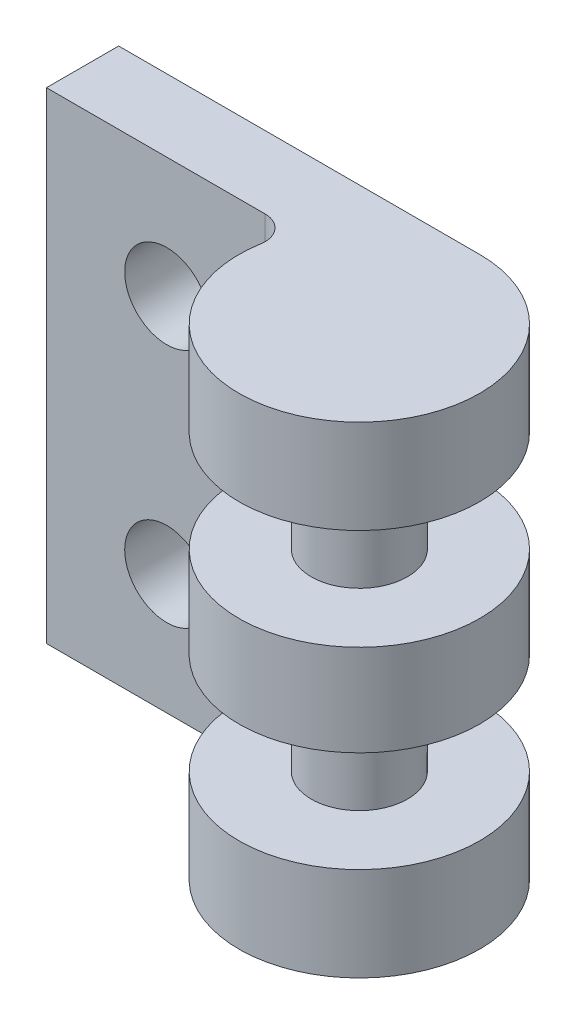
ISO-10303-21;
HEADER;
FILE_DESCRIPTION(('STEP AP214'),'2;1');
FILE_NAME('part.step','',(''),(''),'','','');
FILE_SCHEMA(('AUTOMOTIVE_DESIGN { 1 0 10303 214 1 1 1 1 }'));
ENDSEC;
DATA;
#1=APPLICATION_CONTEXT('core data for automotive mechanical design processes');
#2=APPLICATION_PROTOCOL_DEFINITION('international standard','automotive_design',2000,#1);
#3=PRODUCT_CONTEXT('',#1,'mechanical');
#4=PRODUCT('Part','Part','',(#3));
#5=PRODUCT_RELATED_PRODUCT_CATEGORY('part','',(#4));
#6=PRODUCT_DEFINITION_FORMATION('','',#4);
#7=PRODUCT_DEFINITION_CONTEXT('part definition',#1,'design');
#8=PRODUCT_DEFINITION('design','',#6,#7);
#9=PRODUCT_DEFINITION_SHAPE('','',#8);
#10=(LENGTH_UNIT() NAMED_UNIT(*) SI_UNIT(.MILLI.,.METRE.));
#11=(NAMED_UNIT(*) PLANE_ANGLE_UNIT() SI_UNIT($,.RADIAN.));
#12=(NAMED_UNIT(*) SI_UNIT($,.STERADIAN.) SOLID_ANGLE_UNIT());
#13=UNCERTAINTY_MEASURE_WITH_UNIT(LENGTH_MEASURE(1.E-05),#10,'distance_accuracy_value','');
#14=(GEOMETRIC_REPRESENTATION_CONTEXT(3) GLOBAL_UNCERTAINTY_ASSIGNED_CONTEXT((#13)) GLOBAL_UNIT_ASSIGNED_CONTEXT((#10,
#11,#12)) REPRESENTATION_CONTEXT('',''));
#15=CARTESIAN_POINT('',(0.,0.,0.));
#16=DIRECTION('',(0.,0.,1.));
#17=DIRECTION('',(1.,0.,0.));
#18=AXIS2_PLACEMENT_3D('',#15,#16,#17);
#19=CARTESIAN_POINT('',(10.,10.,5.));
#20=DIRECTION('',(0.,-1.,0.));
#21=DIRECTION('',(0.,0.,-1.));
#22=AXIS2_PLACEMENT_3D('',#19,#20,#21);
#23=CYLINDRICAL_SURFACE('',#22,5.);
#24=CARTESIAN_POINT('',(10.,10.,5.));
#25=DIRECTION('',(0.,1.,0.));
#26=DIRECTION('',(0.,0.,1.));
#27=AXIS2_PLACEMENT_3D('',#24,#25,#26);
#28=CIRCLE('',#27,5.);
#29=CARTESIAN_POINT('',(5.06993351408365,10.,4.16666666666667));
#30=VERTEX_POINT('',#29);
#31=CARTESIAN_POINT('',(10.,10.,0.));
#32=VERTEX_POINT('',#31);
#33=EDGE_CURVE('E206',#30,#32,#28,.T.);
#34=ORIENTED_EDGE('',*,*,#33,.F.);
#35=DIRECTION('',(0.,-1.,0.));
#36=VECTOR('',#35,1.);
#37=CARTESIAN_POINT('',(5.06993351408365,10.,4.16666666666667));
#38=LINE('',#37,#36);
#39=CARTESIAN_POINT('',(5.06993351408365,6.1,4.16666666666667));
#40=VERTEX_POINT('',#39);
#41=EDGE_CURVE('E289',#30,#40,#38,.T.);
#42=ORIENTED_EDGE('',*,*,#41,.T.);
#43=CARTESIAN_POINT('',(10.,6.1,5.));
#44=DIRECTION('',(0.,1.,0.));
#45=DIRECTION('',(0.,0.,1.));
#46=AXIS2_PLACEMENT_3D('',#43,#44,#45);
#47=CIRCLE('',#46,5.);
#48=CARTESIAN_POINT('',(10.,6.1,0.));
#49=VERTEX_POINT('',#48);
#50=EDGE_CURVE('E252',#40,#49,#47,.T.);
#51=ORIENTED_EDGE('',*,*,#50,.T.);
#52=DIRECTION('',(0.,-1.,0.));
#53=VECTOR('',#52,1.);
#54=CARTESIAN_POINT('',(10.,10.,0.));
#55=LINE('',#54,#53);
#56=EDGE_CURVE('E210',#32,#49,#55,.T.);
#57=ORIENTED_EDGE('',*,*,#56,.F.);
#58=EDGE_LOOP('',(#34,#42,#51,#57));
#59=FACE_BOUND('',#58,.T.);
#60=ADVANCED_FACE('F37',(#59),#23,.T.);
#61=CARTESIAN_POINT('',(10.,-6.1,5.));
#62=DIRECTION('',(0.,-1.,0.));
#63=DIRECTION('',(0.,0.,-1.));
#64=AXIS2_PLACEMENT_3D('',#61,#62,#63);
#65=CIRCLE('',#64,5.);
#66=CARTESIAN_POINT('',(10.,-6.1,0.));
#67=VERTEX_POINT('',#66);
#68=CARTESIAN_POINT('',(5.06993351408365,-6.1,4.16666666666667));
#69=VERTEX_POINT('',#68);
#70=EDGE_CURVE('E163',#67,#69,#65,.T.);
#71=ORIENTED_EDGE('',*,*,#70,.T.);
#72=DIRECTION('',(0.,-1.,0.));
#73=VECTOR('',#72,1.);
#74=CARTESIAN_POINT('',(5.06993351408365,10.,4.16666666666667));
#75=LINE('',#74,#73);
#76=CARTESIAN_POINT('',(5.06993351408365,-10.,4.16666666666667));
#77=VERTEX_POINT('',#76);
#78=EDGE_CURVE('E277',#69,#77,#75,.T.);
#79=ORIENTED_EDGE('',*,*,#78,.T.);
#80=CARTESIAN_POINT('',(10.,-10.,5.));
#81=DIRECTION('',(0.,1.,0.));
#82=DIRECTION('',(0.,0.,1.));
#83=AXIS2_PLACEMENT_3D('',#80,#81,#82);
#84=CIRCLE('',#83,5.);
#85=CARTESIAN_POINT('',(10.,-10.,0.));
#86=VERTEX_POINT('',#85);
#87=EDGE_CURVE('E205',#77,#86,#84,.T.);
#88=ORIENTED_EDGE('',*,*,#87,.T.);
#89=EDGE_CURVE('E208',#67,#86,#55,.T.);
#90=ORIENTED_EDGE('',*,*,#89,.F.);
#91=EDGE_LOOP('',(#71,#79,#88,#90));
#92=FACE_BOUND('',#91,.T.);
#93=ADVANCED_FACE('F328',(#92),#23,.T.);
#94=CARTESIAN_POINT('',(0.,0.,3.));
#95=DIRECTION('',(0.,0.,-1.));
#96=DIRECTION('',(-1.,0.,0.));
#97=AXIS2_PLACEMENT_3D('',#94,#95,#96);
#98=PLANE('',#97);
#99=DIRECTION('',(1.,0.,0.));
#100=VECTOR('',#99,1.);
#101=CARTESIAN_POINT('',(-5.,-10.,3.));
#102=LINE('',#101,#100);
#103=CARTESIAN_POINT('',(-5.,-10.,3.));
#104=VERTEX_POINT('',#103);
#105=CARTESIAN_POINT('',(4.08392021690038,-10.,3.));
#106=VERTEX_POINT('',#105);
#107=EDGE_CURVE('E232',#104,#106,#102,.T.);
#108=ORIENTED_EDGE('',*,*,#107,.T.);
#109=DIRECTION('',(0.,1.,0.));
#110=VECTOR('',#109,1.);
#111=CARTESIAN_POINT('',(4.08392021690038,-6.1,3.));
#112=LINE('',#111,#110);
#113=CARTESIAN_POINT('',(4.08392021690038,-6.1,3.));
#114=VERTEX_POINT('',#113);
#115=EDGE_CURVE('E284',#106,#114,#112,.T.);
#116=ORIENTED_EDGE('',*,*,#115,.T.);
#117=DIRECTION('',(-1.,0.,0.));
#118=VECTOR('',#117,1.);
#119=CARTESIAN_POINT('',(0.,-6.1,3.));
#120=LINE('',#119,#118);
#121=CARTESIAN_POINT('',(4.,-6.1,3.));
#122=VERTEX_POINT('',#121);
#123=EDGE_CURVE('E168',#114,#122,#120,.T.);
#124=ORIENTED_EDGE('',*,*,#123,.T.);
#125=DIRECTION('',(0.,1.,0.));
#126=VECTOR('',#125,1.);
#127=CARTESIAN_POINT('',(4.,0.,3.));
#128=LINE('',#127,#126);
#129=CARTESIAN_POINT('',(4.,-1.9,3.));
#130=VERTEX_POINT('',#129);
#131=EDGE_CURVE('E261',#122,#130,#128,.T.);
#132=ORIENTED_EDGE('',*,*,#131,.T.);
#133=DIRECTION('',(1.,0.,0.));
#134=VECTOR('',#133,1.);
#135=CARTESIAN_POINT('',(0.,-1.9,3.));
#136=LINE('',#135,#134);
#137=CARTESIAN_POINT('',(4.08392021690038,-1.9,3.));
#138=VERTEX_POINT('',#137);
#139=EDGE_CURVE('E192',#130,#138,#136,.T.);
#140=ORIENTED_EDGE('',*,*,#139,.T.);
#141=DIRECTION('',(0.,1.,0.));
#142=VECTOR('',#141,1.);
#143=CARTESIAN_POINT('',(4.08392021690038,1.9,3.));
#144=LINE('',#143,#142);
#145=CARTESIAN_POINT('',(4.08392021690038,1.9,3.));
#146=VERTEX_POINT('',#145);
#147=EDGE_CURVE('E282',#138,#146,#144,.T.);
#148=ORIENTED_EDGE('',*,*,#147,.T.);
#149=DIRECTION('',(-1.,0.,0.));
#150=VECTOR('',#149,1.);
#151=CARTESIAN_POINT('',(0.,1.9,3.));
#152=LINE('',#151,#150);
#153=CARTESIAN_POINT('',(4.,1.9,3.));
#154=VERTEX_POINT('',#153);
#155=EDGE_CURVE('E190',#146,#154,#152,.T.);
#156=ORIENTED_EDGE('',*,*,#155,.T.);
#157=DIRECTION('',(0.,1.,0.));
#158=VECTOR('',#157,1.);
#159=CARTESIAN_POINT('',(4.,0.,3.));
#160=LINE('',#159,#158);
#161=CARTESIAN_POINT('',(4.,6.1,3.));
#162=VERTEX_POINT('',#161);
#163=EDGE_CURVE('E258',#154,#162,#160,.T.);
#164=ORIENTED_EDGE('',*,*,#163,.T.);
#165=DIRECTION('',(1.,0.,0.));
#166=VECTOR('',#165,1.);
#167=CARTESIAN_POINT('',(0.,6.1,3.));
#168=LINE('',#167,#166);
#169=CARTESIAN_POINT('',(4.08392021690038,6.1,3.));
#170=VERTEX_POINT('',#169);
#171=EDGE_CURVE('E200',#162,#170,#168,.T.);
#172=ORIENTED_EDGE('',*,*,#171,.T.);
#173=DIRECTION('',(0.,1.,0.));
#174=VECTOR('',#173,1.);
#175=CARTESIAN_POINT('',(4.08392021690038,10.,3.));
#176=LINE('',#175,#174);
#177=CARTESIAN_POINT('',(4.08392021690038,10.,3.));
#178=VERTEX_POINT('',#177);
#179=EDGE_CURVE('E280',#170,#178,#176,.T.);
#180=ORIENTED_EDGE('',*,*,#179,.T.);
#181=DIRECTION('',(-1.,0.,0.));
#182=VECTOR('',#181,1.);
#183=CARTESIAN_POINT('',(-5.,10.,3.));
#184=LINE('',#183,#182);
#185=CARTESIAN_POINT('',(-5.,10.,3.));
#186=VERTEX_POINT('',#185);
#187=EDGE_CURVE('E227',#178,#186,#184,.T.);
#188=ORIENTED_EDGE('',*,*,#187,.T.);
#189=DIRECTION('',(0.,-1.,0.));
#190=VECTOR('',#189,1.);
#191=CARTESIAN_POINT('',(-5.,-10.,3.));
#192=LINE('',#191,#190);
#193=EDGE_CURVE('E229',#186,#104,#192,.T.);
#194=ORIENTED_EDGE('',*,*,#193,.T.);
#195=EDGE_LOOP('',(#108,#116,#124,#132,#140,#148,#156,#164,#172,#180,#188,#194));
#196=FACE_BOUND('',#195,.T.);
#197=CARTESIAN_POINT('',(0.,5.,3.));
#198=DIRECTION('',(0.,0.,1.));
#199=DIRECTION('',(1.,0.,0.));
#200=AXIS2_PLACEMENT_3D('',#197,#198,#199);
#201=CIRCLE('',#200,1.75);
#202=CARTESIAN_POINT('',(1.75,5.,3.));
#203=VERTEX_POINT('',#202);
#204=EDGE_CURVE('E221',#203,#203,#201,.T.);
#205=ORIENTED_EDGE('',*,*,#204,.F.);
#206=EDGE_LOOP('',(#205));
#207=FACE_BOUND('',#206,.T.);
#208=CARTESIAN_POINT('',(0.,-5.,3.));
#209=DIRECTION('',(0.,0.,1.));
#210=DIRECTION('',(-1.,0.,0.));
#211=AXIS2_PLACEMENT_3D('',#208,#209,#210);
#212=CIRCLE('',#211,1.75);
#213=CARTESIAN_POINT('',(-1.75,-5.,3.));
#214=VERTEX_POINT('',#213);
#215=EDGE_CURVE('E215',#214,#214,#212,.T.);
#216=ORIENTED_EDGE('',*,*,#215,.F.);
#217=EDGE_LOOP('',(#216));
#218=FACE_BOUND('',#217,.T.);
#219=ADVANCED_FACE('F304',(#196,#207,#218),#98,.F.);
#220=CARTESIAN_POINT('',(0.,0.,0.));
#221=DIRECTION('',(0.,0.,-1.));
#222=DIRECTION('',(-1.,0.,0.));
#223=AXIS2_PLACEMENT_3D('',#220,#221,#222);
#224=PLANE('',#223);
#225=DIRECTION('',(1.,0.,0.));
#226=VECTOR('',#225,1.);
#227=CARTESIAN_POINT('',(0.,6.1,0.));
#228=LINE('',#227,#226);
#229=CARTESIAN_POINT('',(5.,6.1,0.));
#230=VERTEX_POINT('',#229);
#231=EDGE_CURVE('E197',#230,#49,#228,.T.);
#232=ORIENTED_EDGE('',*,*,#231,.F.);
#233=DIRECTION('',(0.,1.,0.));
#234=VECTOR('',#233,1.);
#235=CARTESIAN_POINT('',(5.,0.,0.));
#236=LINE('',#235,#234);
#237=CARTESIAN_POINT('',(5.,1.9,0.));
#238=VERTEX_POINT('',#237);
#239=EDGE_CURVE('E203',#238,#230,#236,.T.);
#240=ORIENTED_EDGE('',*,*,#239,.F.);
#241=DIRECTION('',(-1.,0.,0.));
#242=VECTOR('',#241,1.);
#243=CARTESIAN_POINT('',(0.,1.9,0.));
#244=LINE('',#243,#242);
#245=CARTESIAN_POINT('',(10.,1.9,0.));
#246=VERTEX_POINT('',#245);
#247=EDGE_CURVE('E188',#246,#238,#244,.T.);
#248=ORIENTED_EDGE('',*,*,#247,.F.);
#249=CARTESIAN_POINT('',(10.,-1.9,0.));
#250=VERTEX_POINT('',#249);
#251=EDGE_CURVE('E214',#246,#250,#55,.T.);
#252=ORIENTED_EDGE('',*,*,#251,.T.);
#253=DIRECTION('',(1.,0.,0.));
#254=VECTOR('',#253,1.);
#255=CARTESIAN_POINT('',(0.,-1.9,0.));
#256=LINE('',#255,#254);
#257=CARTESIAN_POINT('',(5.,-1.9,0.));
#258=VERTEX_POINT('',#257);
#259=EDGE_CURVE('E187',#258,#250,#256,.T.);
#260=ORIENTED_EDGE('',*,*,#259,.F.);
#261=DIRECTION('',(0.,1.,0.));
#262=VECTOR('',#261,1.);
#263=CARTESIAN_POINT('',(5.,0.,0.));
#264=LINE('',#263,#262);
#265=CARTESIAN_POINT('',(5.,-6.1,0.));
#266=VERTEX_POINT('',#265);
#267=EDGE_CURVE('E174',#266,#258,#264,.T.);
#268=ORIENTED_EDGE('',*,*,#267,.F.);
#269=DIRECTION('',(-1.,0.,0.));
#270=VECTOR('',#269,1.);
#271=CARTESIAN_POINT('',(0.,-6.1,0.));
#272=LINE('',#271,#270);
#273=EDGE_CURVE('E155',#67,#266,#272,.T.);
#274=ORIENTED_EDGE('',*,*,#273,.F.);
#275=ORIENTED_EDGE('',*,*,#89,.T.);
#276=DIRECTION('',(1.,0.,0.));
#277=VECTOR('',#276,1.);
#278=CARTESIAN_POINT('',(-5.,-10.,0.));
#279=LINE('',#278,#277);
#280=CARTESIAN_POINT('',(-5.,-10.,0.));
#281=VERTEX_POINT('',#280);
#282=EDGE_CURVE('E230',#281,#86,#279,.T.);
#283=ORIENTED_EDGE('',*,*,#282,.F.);
#284=DIRECTION('',(0.,-1.,0.));
#285=VECTOR('',#284,1.);
#286=CARTESIAN_POINT('',(-5.,-10.,0.));
#287=LINE('',#286,#285);
#288=CARTESIAN_POINT('',(-5.,10.,0.));
#289=VERTEX_POINT('',#288);
#290=EDGE_CURVE('E237',#289,#281,#287,.T.);
#291=ORIENTED_EDGE('',*,*,#290,.F.);
#292=DIRECTION('',(-1.,0.,0.));
#293=VECTOR('',#292,1.);
#294=CARTESIAN_POINT('',(-5.,10.,0.));
#295=LINE('',#294,#293);
#296=EDGE_CURVE('E224',#32,#289,#295,.T.);
#297=ORIENTED_EDGE('',*,*,#296,.F.);
#298=ORIENTED_EDGE('',*,*,#56,.T.);
#299=EDGE_LOOP('',(#232,#240,#248,#252,#260,#268,#274,#275,#283,#291,#297,#298));
#300=FACE_BOUND('',#299,.T.);
#301=CARTESIAN_POINT('',(0.,5.,0.));
#302=DIRECTION('',(0.,0.,1.));
#303=DIRECTION('',(1.,0.,0.));
#304=AXIS2_PLACEMENT_3D('',#301,#302,#303);
#305=CIRCLE('',#304,1.75);
#306=CARTESIAN_POINT('',(1.75,5.,0.));
#307=VERTEX_POINT('',#306);
#308=EDGE_CURVE('E218',#307,#307,#305,.T.);
#309=ORIENTED_EDGE('',*,*,#308,.T.);
#310=EDGE_LOOP('',(#309));
#311=FACE_BOUND('',#310,.T.);
#312=CARTESIAN_POINT('',(0.,-5.,0.));
#313=DIRECTION('',(0.,0.,1.));
#314=DIRECTION('',(-1.,0.,0.));
#315=AXIS2_PLACEMENT_3D('',#312,#313,#314);
#316=CIRCLE('',#315,1.75);
#317=CARTESIAN_POINT('',(-1.75,-5.,0.));
#318=VERTEX_POINT('',#317);
#319=EDGE_CURVE('E213',#318,#318,#316,.T.);
#320=ORIENTED_EDGE('',*,*,#319,.T.);
#321=EDGE_LOOP('',(#320));
#322=FACE_BOUND('',#321,.T.);
#323=ADVANCED_FACE('F183',(#300,#311,#322),#224,.T.);
#324=CARTESIAN_POINT('',(-5.,10.,3.));
#325=DIRECTION('',(0.,-1.,0.));
#326=DIRECTION('',(0.,0.,-1.));
#327=AXIS2_PLACEMENT_3D('',#324,#325,#326);
#328=PLANE('',#327);
#329=ORIENTED_EDGE('',*,*,#296,.T.);
#330=DIRECTION('',(0.,0.,-1.));
#331=VECTOR('',#330,1.);
#332=CARTESIAN_POINT('',(-5.,10.,3.));
#333=LINE('',#332,#331);
#334=EDGE_CURVE('E243',#186,#289,#333,.T.);
#335=ORIENTED_EDGE('',*,*,#334,.F.);
#336=ORIENTED_EDGE('',*,*,#187,.F.);
#337=CARTESIAN_POINT('',(4.08392021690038,10.,4.));
#338=DIRECTION('',(0.,-1.,0.));
#339=DIRECTION('',(0.,0.,-1.));
#340=AXIS2_PLACEMENT_3D('',#337,#338,#339);
#341=CIRCLE('',#340,1.);
#342=EDGE_CURVE('E11',#178,#30,#341,.T.);
#343=ORIENTED_EDGE('',*,*,#342,.T.);
#344=ORIENTED_EDGE('',*,*,#33,.T.);
#345=EDGE_LOOP('',(#329,#335,#336,#343,#344));
#346=FACE_BOUND('',#345,.T.);
#347=ADVANCED_FACE('F310',(#346),#328,.F.);
#348=CARTESIAN_POINT('',(-5.,-10.,3.));
#349=DIRECTION('',(1.,0.,0.));
#350=DIRECTION('',(0.,1.,0.));
#351=AXIS2_PLACEMENT_3D('',#348,#349,#350);
#352=PLANE('',#351);
#353=ORIENTED_EDGE('',*,*,#290,.T.);
#354=DIRECTION('',(0.,0.,-1.));
#355=VECTOR('',#354,1.);
#356=CARTESIAN_POINT('',(-5.,-10.,3.));
#357=LINE('',#356,#355);
#358=EDGE_CURVE('E235',#104,#281,#357,.T.);
#359=ORIENTED_EDGE('',*,*,#358,.F.);
#360=ORIENTED_EDGE('',*,*,#193,.F.);
#361=ORIENTED_EDGE('',*,*,#334,.T.);
#362=EDGE_LOOP('',(#353,#359,#360,#361));
#363=FACE_BOUND('',#362,.T.);
#364=ADVANCED_FACE('F316',(#363),#352,.F.);
#365=CARTESIAN_POINT('',(-5.,-10.,3.));
#366=DIRECTION('',(0.,1.,0.));
#367=DIRECTION('',(-1.,0.,0.));
#368=AXIS2_PLACEMENT_3D('',#365,#366,#367);
#369=PLANE('',#368);
#370=ORIENTED_EDGE('',*,*,#282,.T.);
#371=ORIENTED_EDGE('',*,*,#87,.F.);
#372=CARTESIAN_POINT('',(4.08392021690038,-10.,4.));
#373=DIRECTION('',(0.,1.,0.));
#374=DIRECTION('',(-1.,0.,0.));
#375=AXIS2_PLACEMENT_3D('',#372,#373,#374);
#376=CIRCLE('',#375,1.);
#377=EDGE_CURVE('E291',#77,#106,#376,.T.);
#378=ORIENTED_EDGE('',*,*,#377,.T.);
#379=ORIENTED_EDGE('',*,*,#107,.F.);
#380=ORIENTED_EDGE('',*,*,#358,.T.);
#381=EDGE_LOOP('',(#370,#371,#378,#379,#380));
#382=FACE_BOUND('',#381,.T.);
#383=ADVANCED_FACE('F320',(#382),#369,.F.);
#384=CARTESIAN_POINT('',(0.,5.,3.));
#385=DIRECTION('',(0.,0.,-1.));
#386=DIRECTION('',(-1.,0.,0.));
#387=AXIS2_PLACEMENT_3D('',#384,#385,#386);
#388=CYLINDRICAL_SURFACE('',#387,1.75);
#389=ORIENTED_EDGE('',*,*,#204,.T.);
#390=EDGE_LOOP('',(#389));
#391=FACE_BOUND('',#390,.T.);
#392=ORIENTED_EDGE('',*,*,#308,.F.);
#393=EDGE_LOOP('',(#392));
#394=FACE_BOUND('',#393,.T.);
#395=ADVANCED_FACE('F396',(#391,#394),#388,.F.);
#396=CARTESIAN_POINT('',(0.,-5.,3.));
#397=DIRECTION('',(0.,0.,-1.));
#398=DIRECTION('',(-1.,0.,0.));
#399=AXIS2_PLACEMENT_3D('',#396,#397,#398);
#400=CYLINDRICAL_SURFACE('',#399,1.75);
#401=ORIENTED_EDGE('',*,*,#215,.T.);
#402=EDGE_LOOP('',(#401));
#403=FACE_BOUND('',#402,.T.);
#404=ORIENTED_EDGE('',*,*,#319,.F.);
#405=EDGE_LOOP('',(#404));
#406=FACE_BOUND('',#405,.T.);
#407=ADVANCED_FACE('F390',(#403,#406),#400,.F.);
#408=CARTESIAN_POINT('',(10.,1.9,5.));
#409=DIRECTION('',(0.,-1.,0.));
#410=DIRECTION('',(1.,0.,0.));
#411=AXIS2_PLACEMENT_3D('',#408,#409,#410);
#412=CIRCLE('',#411,5.);
#413=CARTESIAN_POINT('',(5.06993351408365,1.9,4.16666666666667));
#414=VERTEX_POINT('',#413);
#415=EDGE_CURVE('E249',#246,#414,#412,.T.);
#416=ORIENTED_EDGE('',*,*,#415,.T.);
#417=DIRECTION('',(0.,-1.,0.));
#418=VECTOR('',#417,1.);
#419=CARTESIAN_POINT('',(5.06993351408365,10.,4.16666666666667));
#420=LINE('',#419,#418);
#421=CARTESIAN_POINT('',(5.06993351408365,-1.9,4.16666666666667));
#422=VERTEX_POINT('',#421);
#423=EDGE_CURVE('E286',#414,#422,#420,.T.);
#424=ORIENTED_EDGE('',*,*,#423,.T.);
#425=CARTESIAN_POINT('',(10.,-1.9,5.));
#426=DIRECTION('',(0.,1.,0.));
#427=DIRECTION('',(-1.,0.,0.));
#428=AXIS2_PLACEMENT_3D('',#425,#426,#427);
#429=CIRCLE('',#428,5.);
#430=EDGE_CURVE('E247',#422,#250,#429,.T.);
#431=ORIENTED_EDGE('',*,*,#430,.T.);
#432=ORIENTED_EDGE('',*,*,#251,.F.);
#433=EDGE_LOOP('',(#416,#424,#431,#432));
#434=FACE_BOUND('',#433,.T.);
#435=ADVANCED_FACE('F333',(#434),#23,.T.);
#436=CARTESIAN_POINT('',(5.,-6.1,-7.));
#437=DIRECTION('',(-1.,0.,0.));
#438=DIRECTION('',(0.,-1.,0.));
#439=AXIS2_PLACEMENT_3D('',#436,#437,#438);
#440=PLANE('',#439);
#441=DIRECTION('',(0.,0.,1.));
#442=VECTOR('',#441,1.);
#443=CARTESIAN_POINT('',(5.,-1.9,-7.));
#444=LINE('',#443,#442);
#445=CARTESIAN_POINT('',(5.,-1.9,2.));
#446=VERTEX_POINT('',#445);
#447=EDGE_CURVE('E179',#258,#446,#444,.T.);
#448=ORIENTED_EDGE('',*,*,#447,.T.);
#449=DIRECTION('',(0.,1.,0.));
#450=VECTOR('',#449,1.);
#451=CARTESIAN_POINT('',(5.,-6.1,2.));
#452=LINE('',#451,#450);
#453=CARTESIAN_POINT('',(5.,-6.1,2.));
#454=VERTEX_POINT('',#453);
#455=EDGE_CURVE('E177',#446,#454,#452,.F.);
#456=ORIENTED_EDGE('',*,*,#455,.T.);
#457=DIRECTION('',(0.,0.,1.));
#458=VECTOR('',#457,1.);
#459=CARTESIAN_POINT('',(5.,-6.1,-7.));
#460=LINE('',#459,#458);
#461=EDGE_CURVE('E160',#266,#454,#460,.T.);
#462=ORIENTED_EDGE('',*,*,#461,.F.);
#463=ORIENTED_EDGE('',*,*,#267,.T.);
#464=EDGE_LOOP('',(#448,#456,#462,#463));
#465=FACE_BOUND('',#464,.T.);
#466=ADVANCED_FACE('F173',(#465),#440,.F.);
#467=CARTESIAN_POINT('',(5.,-1.9,-7.));
#468=DIRECTION('',(0.,1.,0.));
#469=DIRECTION('',(-1.,0.,0.));
#470=AXIS2_PLACEMENT_3D('',#467,#468,#469);
#471=PLANE('',#470);
#472=CARTESIAN_POINT('',(10.,-1.9,5.));
#473=DIRECTION('',(0.,1.,0.));
#474=DIRECTION('',(-1.,0.,0.));
#475=AXIS2_PLACEMENT_3D('',#472,#473,#474);
#476=CIRCLE('',#475,2.);
#477=CARTESIAN_POINT('',(8.,-1.9,5.));
#478=VERTEX_POINT('',#477);
#479=EDGE_CURVE('E262',#478,#478,#476,.F.);
#480=ORIENTED_EDGE('',*,*,#479,.F.);
#481=EDGE_LOOP('',(#480));
#482=FACE_BOUND('',#481,.T.);
#483=ORIENTED_EDGE('',*,*,#259,.T.);
#484=ORIENTED_EDGE('',*,*,#430,.F.);
#485=CARTESIAN_POINT('',(4.08392021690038,-1.9,4.));
#486=DIRECTION('',(0.,1.,0.));
#487=DIRECTION('',(-1.,0.,0.));
#488=AXIS2_PLACEMENT_3D('',#485,#486,#487);
#489=CIRCLE('',#488,1.);
#490=EDGE_CURVE('E295',#422,#138,#489,.T.);
#491=ORIENTED_EDGE('',*,*,#490,.T.);
#492=ORIENTED_EDGE('',*,*,#139,.F.);
#493=CARTESIAN_POINT('',(4.,-1.9,2.));
#494=DIRECTION('',(0.,1.,0.));
#495=DIRECTION('',(-1.,0.,0.));
#496=AXIS2_PLACEMENT_3D('',#493,#494,#495);
#497=CIRCLE('',#496,1.);
#498=EDGE_CURVE('E268',#130,#446,#497,.T.);
#499=ORIENTED_EDGE('',*,*,#498,.T.);
#500=ORIENTED_EDGE('',*,*,#447,.F.);
#501=EDGE_LOOP('',(#483,#484,#491,#492,#499,#500));
#502=FACE_BOUND('',#501,.T.);
#503=ADVANCED_FACE('F337',(#482,#502),#471,.F.);
#504=CARTESIAN_POINT('',(5.,-6.1,-7.));
#505=DIRECTION('',(0.,-1.,0.));
#506=DIRECTION('',(0.,0.,-1.));
#507=AXIS2_PLACEMENT_3D('',#504,#505,#506);
#508=PLANE('',#507);
#509=CARTESIAN_POINT('',(10.,-6.1,5.));
#510=DIRECTION('',(0.,-1.,0.));
#511=DIRECTION('',(0.,0.,-1.));
#512=AXIS2_PLACEMENT_3D('',#509,#510,#511);
#513=CIRCLE('',#512,2.);
#514=CARTESIAN_POINT('',(10.,-6.1,3.));
#515=VERTEX_POINT('',#514);
#516=EDGE_CURVE('E364',#515,#515,#513,.F.);
#517=ORIENTED_EDGE('',*,*,#516,.F.);
#518=EDGE_LOOP('',(#517));
#519=FACE_BOUND('',#518,.T.);
#520=ORIENTED_EDGE('',*,*,#123,.F.);
#521=CARTESIAN_POINT('',(4.08392021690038,-6.1,4.));
#522=DIRECTION('',(0.,-1.,0.));
#523=DIRECTION('',(0.,0.,-1.));
#524=AXIS2_PLACEMENT_3D('',#521,#522,#523);
#525=CIRCLE('',#524,1.);
#526=EDGE_CURVE('E293',#114,#69,#525,.T.);
#527=ORIENTED_EDGE('',*,*,#526,.T.);
#528=ORIENTED_EDGE('',*,*,#70,.F.);
#529=ORIENTED_EDGE('',*,*,#273,.T.);
#530=ORIENTED_EDGE('',*,*,#461,.T.);
#531=CARTESIAN_POINT('',(4.,-6.1,2.));
#532=DIRECTION('',(0.,-1.,0.));
#533=DIRECTION('',(0.,0.,-1.));
#534=AXIS2_PLACEMENT_3D('',#531,#532,#533);
#535=CIRCLE('',#534,1.);
#536=EDGE_CURVE('E270',#454,#122,#535,.T.);
#537=ORIENTED_EDGE('',*,*,#536,.T.);
#538=EDGE_LOOP('',(#520,#527,#528,#529,#530,#537));
#539=FACE_BOUND('',#538,.T.);
#540=ADVANCED_FACE('F158',(#519,#539),#508,.F.);
#541=CARTESIAN_POINT('',(5.,6.1,-7.));
#542=DIRECTION('',(-1.,0.,0.));
#543=DIRECTION('',(0.,-1.,0.));
#544=AXIS2_PLACEMENT_3D('',#541,#542,#543);
#545=PLANE('',#544);
#546=DIRECTION('',(0.,0.,1.));
#547=VECTOR('',#546,1.);
#548=CARTESIAN_POINT('',(5.,6.1,-7.));
#549=LINE('',#548,#547);
#550=CARTESIAN_POINT('',(5.,6.1,2.));
#551=VERTEX_POINT('',#550);
#552=EDGE_CURVE('E169',#230,#551,#549,.T.);
#553=ORIENTED_EDGE('',*,*,#552,.T.);
#554=DIRECTION('',(0.,1.,0.));
#555=VECTOR('',#554,1.);
#556=CARTESIAN_POINT('',(5.,6.1,2.));
#557=LINE('',#556,#555);
#558=CARTESIAN_POINT('',(5.,1.9,2.));
#559=VERTEX_POINT('',#558);
#560=EDGE_CURVE('E266',#551,#559,#557,.F.);
#561=ORIENTED_EDGE('',*,*,#560,.T.);
#562=DIRECTION('',(0.,0.,1.));
#563=VECTOR('',#562,1.);
#564=CARTESIAN_POINT('',(5.,1.9,-7.));
#565=LINE('',#564,#563);
#566=EDGE_CURVE('E178',#238,#559,#565,.T.);
#567=ORIENTED_EDGE('',*,*,#566,.F.);
#568=ORIENTED_EDGE('',*,*,#239,.T.);
#569=EDGE_LOOP('',(#553,#561,#567,#568));
#570=FACE_BOUND('',#569,.T.);
#571=ADVANCED_FACE('F359',(#570),#545,.F.);
#572=CARTESIAN_POINT('',(5.,6.1,-7.));
#573=DIRECTION('',(0.,1.,0.));
#574=DIRECTION('',(0.,0.,1.));
#575=AXIS2_PLACEMENT_3D('',#572,#573,#574);
#576=PLANE('',#575);
#577=CARTESIAN_POINT('',(10.,6.1,5.));
#578=DIRECTION('',(0.,1.,0.));
#579=DIRECTION('',(0.,0.,1.));
#580=AXIS2_PLACEMENT_3D('',#577,#578,#579);
#581=CIRCLE('',#580,2.);
#582=CARTESIAN_POINT('',(10.,6.1,7.));
#583=VERTEX_POINT('',#582);
#584=EDGE_CURVE('E257',#583,#583,#581,.F.);
#585=ORIENTED_EDGE('',*,*,#584,.F.);
#586=EDGE_LOOP('',(#585));
#587=FACE_BOUND('',#586,.T.);
#588=ORIENTED_EDGE('',*,*,#552,.F.);
#589=ORIENTED_EDGE('',*,*,#231,.T.);
#590=ORIENTED_EDGE('',*,*,#50,.F.);
#591=CARTESIAN_POINT('',(4.08392021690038,6.1,4.));
#592=DIRECTION('',(0.,1.,0.));
#593=DIRECTION('',(0.,0.,1.));
#594=AXIS2_PLACEMENT_3D('',#591,#592,#593);
#595=CIRCLE('',#594,1.);
#596=EDGE_CURVE('E45',#40,#170,#595,.T.);
#597=ORIENTED_EDGE('',*,*,#596,.T.);
#598=ORIENTED_EDGE('',*,*,#171,.F.);
#599=CARTESIAN_POINT('',(4.,6.1,2.));
#600=DIRECTION('',(0.,1.,0.));
#601=DIRECTION('',(0.,0.,1.));
#602=AXIS2_PLACEMENT_3D('',#599,#600,#601);
#603=CIRCLE('',#602,1.);
#604=EDGE_CURVE('E272',#162,#551,#603,.T.);
#605=ORIENTED_EDGE('',*,*,#604,.T.);
#606=EDGE_LOOP('',(#588,#589,#590,#597,#598,#605));
#607=FACE_BOUND('',#606,.T.);
#608=ADVANCED_FACE('F301',(#587,#607),#576,.F.);
#609=CARTESIAN_POINT('',(5.,1.9,-7.));
#610=DIRECTION('',(0.,-1.,0.));
#611=DIRECTION('',(1.,0.,0.));
#612=AXIS2_PLACEMENT_3D('',#609,#610,#611);
#613=PLANE('',#612);
#614=CARTESIAN_POINT('',(10.,1.9,5.));
#615=DIRECTION('',(0.,-1.,0.));
#616=DIRECTION('',(1.,0.,0.));
#617=AXIS2_PLACEMENT_3D('',#614,#615,#616);
#618=CIRCLE('',#617,2.);
#619=CARTESIAN_POINT('',(12.,1.9,5.));
#620=VERTEX_POINT('',#619);
#621=EDGE_CURVE('E254',#620,#620,#618,.F.);
#622=ORIENTED_EDGE('',*,*,#621,.F.);
#623=EDGE_LOOP('',(#622));
#624=FACE_BOUND('',#623,.T.);
#625=ORIENTED_EDGE('',*,*,#155,.F.);
#626=CARTESIAN_POINT('',(4.08392021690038,1.9,4.));
#627=DIRECTION('',(0.,-1.,0.));
#628=DIRECTION('',(1.,0.,0.));
#629=AXIS2_PLACEMENT_3D('',#626,#627,#628);
#630=CIRCLE('',#629,1.);
#631=EDGE_CURVE('E297',#146,#414,#630,.T.);
#632=ORIENTED_EDGE('',*,*,#631,.T.);
#633=ORIENTED_EDGE('',*,*,#415,.F.);
#634=ORIENTED_EDGE('',*,*,#247,.T.);
#635=ORIENTED_EDGE('',*,*,#566,.T.);
#636=CARTESIAN_POINT('',(4.,1.9,2.));
#637=DIRECTION('',(0.,-1.,0.));
#638=DIRECTION('',(1.,0.,0.));
#639=AXIS2_PLACEMENT_3D('',#636,#637,#638);
#640=CIRCLE('',#639,1.);
#641=EDGE_CURVE('E274',#559,#154,#640,.T.);
#642=ORIENTED_EDGE('',*,*,#641,.T.);
#643=EDGE_LOOP('',(#625,#632,#633,#634,#635,#642));
#644=FACE_BOUND('',#643,.T.);
#645=ADVANCED_FACE('F350',(#624,#644),#613,.F.);
#646=CARTESIAN_POINT('',(10.,10.,5.));
#647=DIRECTION('',(0.,-1.,0.));
#648=DIRECTION('',(0.,0.,-1.));
#649=AXIS2_PLACEMENT_3D('',#646,#647,#648);
#650=CYLINDRICAL_SURFACE('',#649,2.);
#651=ORIENTED_EDGE('',*,*,#621,.T.);
#652=EDGE_LOOP('',(#651));
#653=FACE_BOUND('',#652,.T.);
#654=ORIENTED_EDGE('',*,*,#584,.T.);
#655=EDGE_LOOP('',(#654));
#656=FACE_BOUND('',#655,.T.);
#657=ADVANCED_FACE('F370',(#653,#656),#650,.T.);
#658=ORIENTED_EDGE('',*,*,#516,.T.);
#659=EDGE_LOOP('',(#658));
#660=FACE_BOUND('',#659,.T.);
#661=ORIENTED_EDGE('',*,*,#479,.T.);
#662=EDGE_LOOP('',(#661));
#663=FACE_BOUND('',#662,.T.);
#664=ADVANCED_FACE('F418',(#660,#663),#650,.T.);
#665=CARTESIAN_POINT('',(4.,0.,2.));
#666=DIRECTION('',(0.,1.,0.));
#667=DIRECTION('',(-1.,0.,0.));
#668=AXIS2_PLACEMENT_3D('',#665,#666,#667);
#669=CYLINDRICAL_SURFACE('',#668,1.);
#670=ORIENTED_EDGE('',*,*,#536,.F.);
#671=ORIENTED_EDGE('',*,*,#455,.F.);
#672=ORIENTED_EDGE('',*,*,#498,.F.);
#673=ORIENTED_EDGE('',*,*,#131,.F.);
#674=EDGE_LOOP('',(#670,#671,#672,#673));
#675=FACE_BOUND('',#674,.T.);
#676=ADVANCED_FACE('F415',(#675),#669,.T.);
#677=CARTESIAN_POINT('',(4.,0.,2.));
#678=DIRECTION('',(0.,1.,0.));
#679=DIRECTION('',(-1.,0.,0.));
#680=AXIS2_PLACEMENT_3D('',#677,#678,#679);
#681=CYLINDRICAL_SURFACE('',#680,1.);
#682=ORIENTED_EDGE('',*,*,#641,.F.);
#683=ORIENTED_EDGE('',*,*,#560,.F.);
#684=ORIENTED_EDGE('',*,*,#604,.F.);
#685=ORIENTED_EDGE('',*,*,#163,.F.);
#686=EDGE_LOOP('',(#682,#683,#684,#685));
#687=FACE_BOUND('',#686,.T.);
#688=ADVANCED_FACE('F356',(#687),#681,.T.);
#689=CARTESIAN_POINT('',(4.08392021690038,10.,4.));
#690=DIRECTION('',(0.,-1.,0.));
#691=DIRECTION('',(0.,0.,-1.));
#692=AXIS2_PLACEMENT_3D('',#689,#690,#691);
#693=CYLINDRICAL_SURFACE('',#692,1.);
#694=ORIENTED_EDGE('',*,*,#526,.F.);
#695=ORIENTED_EDGE('',*,*,#115,.F.);
#696=ORIENTED_EDGE('',*,*,#377,.F.);
#697=ORIENTED_EDGE('',*,*,#78,.F.);
#698=EDGE_LOOP('',(#694,#695,#696,#697));
#699=FACE_BOUND('',#698,.T.);
#700=ADVANCED_FACE('F325',(#699),#693,.F.);
#701=CARTESIAN_POINT('',(4.08392021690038,10.,4.));
#702=DIRECTION('',(0.,-1.,0.));
#703=DIRECTION('',(0.,0.,-1.));
#704=AXIS2_PLACEMENT_3D('',#701,#702,#703);
#705=CYLINDRICAL_SURFACE('',#704,1.);
#706=ORIENTED_EDGE('',*,*,#631,.F.);
#707=ORIENTED_EDGE('',*,*,#147,.F.);
#708=ORIENTED_EDGE('',*,*,#490,.F.);
#709=ORIENTED_EDGE('',*,*,#423,.F.);
#710=EDGE_LOOP('',(#706,#707,#708,#709));
#711=FACE_BOUND('',#710,.T.);
#712=ADVANCED_FACE('F348',(#711),#705,.F.);
#713=CARTESIAN_POINT('',(4.08392021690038,10.,4.));
#714=DIRECTION('',(0.,-1.,0.));
#715=DIRECTION('',(0.,0.,-1.));
#716=AXIS2_PLACEMENT_3D('',#713,#714,#715);
#717=CYLINDRICAL_SURFACE('',#716,1.);
#718=ORIENTED_EDGE('',*,*,#342,.F.);
#719=ORIENTED_EDGE('',*,*,#179,.F.);
#720=ORIENTED_EDGE('',*,*,#596,.F.);
#721=ORIENTED_EDGE('',*,*,#41,.F.);
#722=EDGE_LOOP('',(#718,#719,#720,#721));
#723=FACE_BOUND('',#722,.T.);
#724=ADVANCED_FACE('F39',(#723),#717,.F.);
#725=CLOSED_SHELL('',(#60,#93,#219,#323,#347,#364,#383,#395,#407,#435,#466,#503,#540,#571,#608,
#645,#657,#664,#676,#688,#700,#712,#724));
#726=MANIFOLD_SOLID_BREP('B2',#725);
#727=ADVANCED_BREP_SHAPE_REPRESENTATION('',(#18,#726),#14);
#728=SHAPE_DEFINITION_REPRESENTATION(#9,#727);
ENDSEC;
END-ISO-10303-21;
